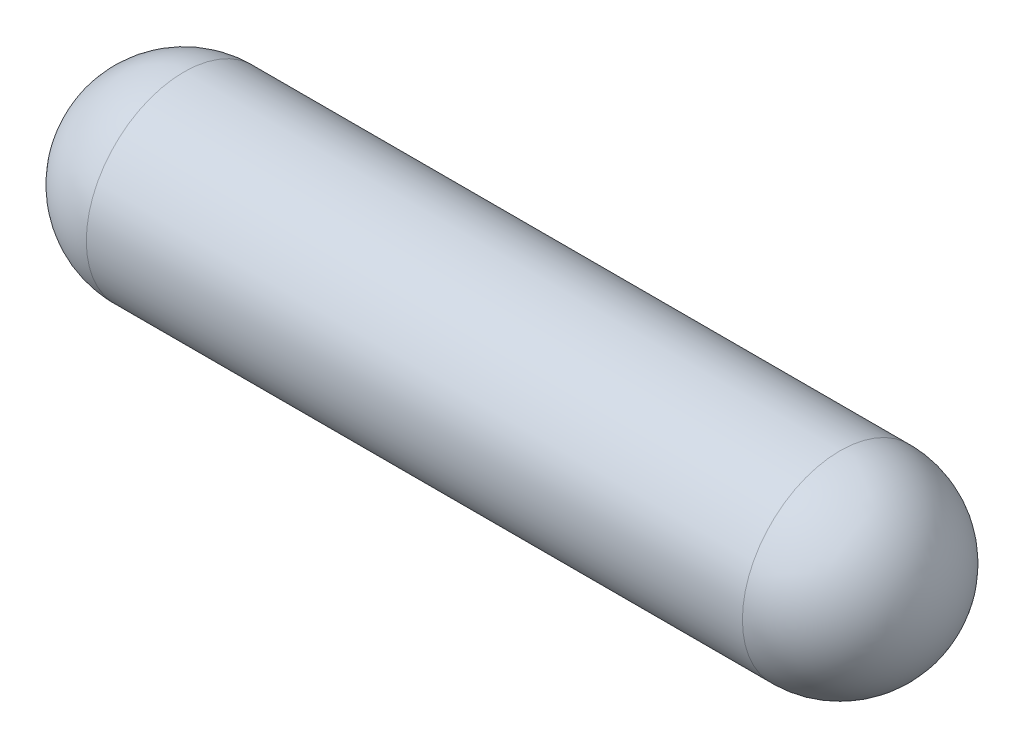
from build123d import *


with BuildPart() as part:
    # Sketch1 → Base-Revolve (revolve)
    with BuildSketch(Plane.XY, mode=Mode.PRIVATE) as base_revolve_sk:
        with BuildLine():
            Line((-20.828, 2.3876), (0, 2.3876))
            ThreePointArc((0, 2.3876), (-0.699311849, 4.075888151), (-2.3876, 4.7752))
            Line((-2.3876, 4.7752), (-18.4404, 4.7752))
            ThreePointArc((-18.4404, 4.7752), (-20.128688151, 4.075888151), (-20.828, 2.3876))
        make_face()
    revolve(base_revolve_sk.sketch.rotate(Axis((0, 2.3876, 0), (1, 0, 0)), 90), axis=Axis((0, 2.3876, 0), (1, 0, 0)))


solid = part.part
